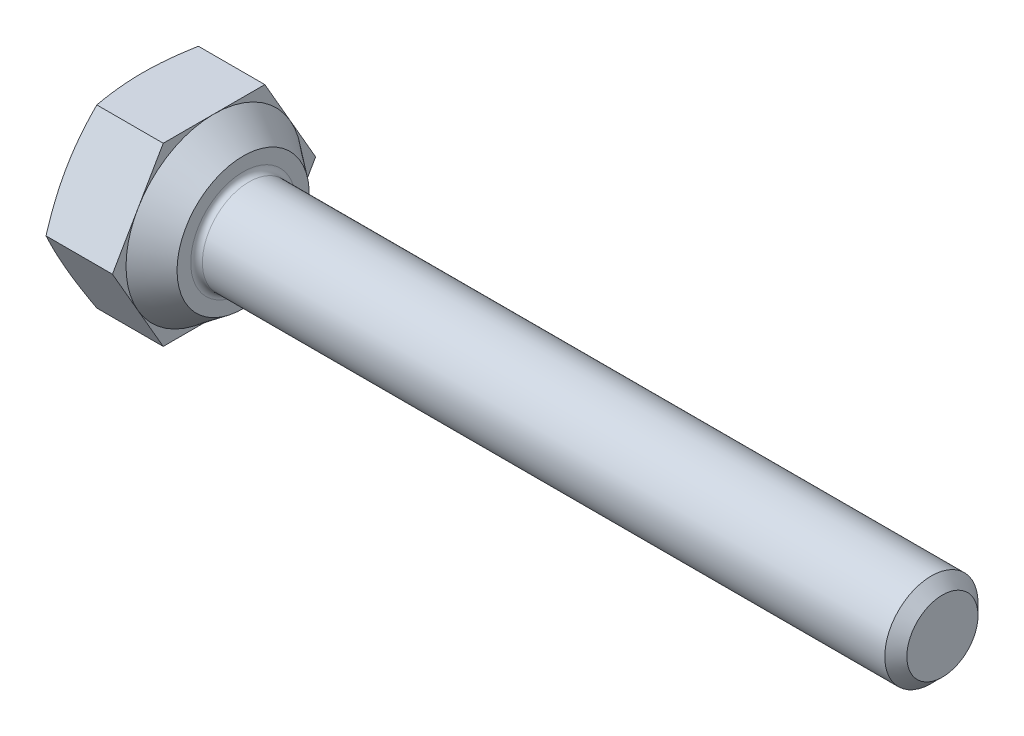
from build123d import *

# Parameters (mm, degrees)
BASEHEAD_DEPTH = 1.225
SKETCH3_R      = 0.8
BASEBODY_DEPTH = 12
HEADFILLET_R   = 0.1
CHAMFER1_SIZE  = 0.1895


with BuildPart() as part:
    # Sketch-BaseHead → BaseHead (new body)
    with BuildSketch(Plane(origin=(0, 0, 0), x_dir=(0, 0, -1), z_dir=(1, 0, 0))):
        Polygon((1.743597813, 0), (0.871798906, 1.51), (-0.871798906, 1.51), (-1.743597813, 0), (-0.871798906, -1.51), (0.871798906, -1.51), align=None)
    extrude(amount=BASEHEAD_DEPTH)

    # Sketch4 → HeadChamfer (revolve, cut)
    with BuildSketch(Plane(origin=(-0.264637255, 0, 5.916896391), x_dir=(0, 0, -1), z_dir=(0, 1, 0))):
        Polygon((7.660494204, -0.264637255), (7.426896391, -0.264637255), (7.660494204, -0.349659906), align=None)
    revolve(axis=Axis((-4.001564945, 0, 0), (1, 0, 0)), mode=Mode.SUBTRACT)

    # Sketch1 → Revolve1 (revolve)
    with BuildSketch(Plane.XY, mode=Mode.PRIVATE) as revolve1_sk:
        Polygon((1.225, 0), (1.725, 0), (1.725, -1.135), (1.225, -1.51), align=None)
    revolve(revolve1_sk.sketch.rotate(Axis((-4.001564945, 0, 0), (1, 0, 0)), 270), axis=Axis((-4.001564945, 0, 0), (1, 0, 0)))

    # Sketch3 → BaseBody (add)
    with BuildSketch(Plane(origin=(1.725, 0, 0), x_dir=(0, 0, -1), z_dir=(1, 0, 0))):
        Circle(SKETCH3_R)
    extrude(amount=BASEBODY_DEPTH)

    # HeadFillet
    headfillet_edges = [part.edges().sort_by_distance(p)[0] for p in [
        (1.725, 0, 0.8),
    ]]
    fillet(headfillet_edges, radius=HEADFILLET_R)

    # Chamfer1
    chamfer1_edges = [part.edges().sort_by_distance(p)[0] for p in [
        (13.725, 0, 0.8),
    ]]
    chamfer(chamfer1_edges, length=CHAMFER1_SIZE)


solid = part.part
